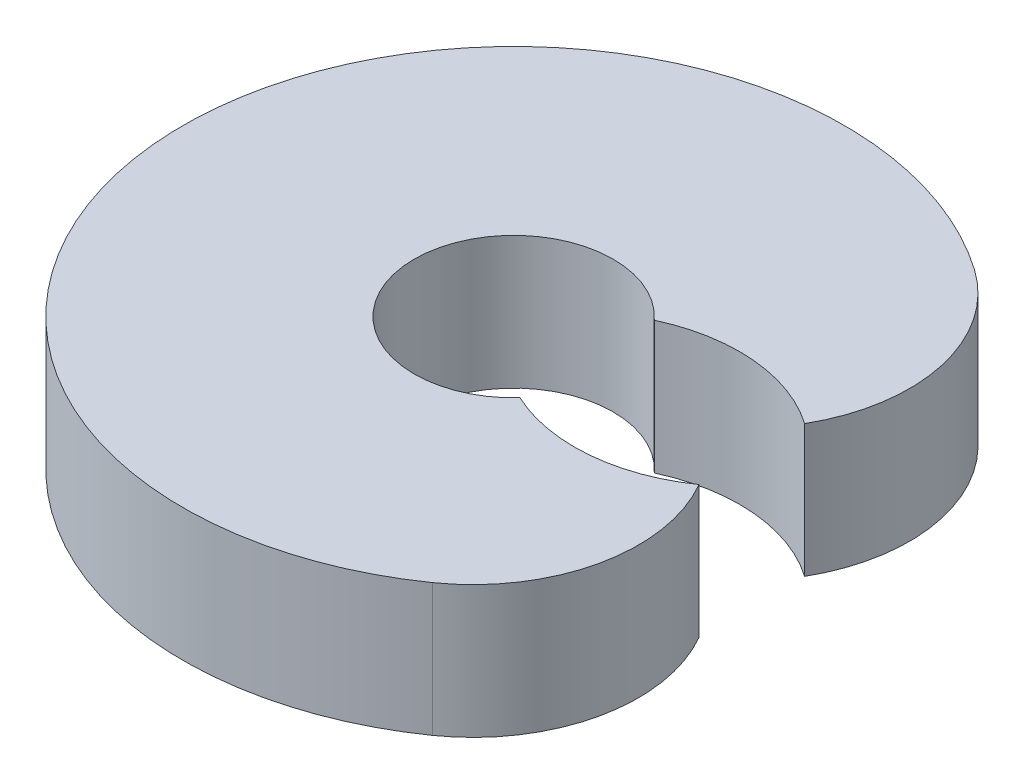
from build123d import *

# Parameters (mm, degrees)
BOSS_EXTRUDE1_START = 5
BOSS_EXTRUDE1_DEPTH = 200


with BuildPart() as part:
    # Sketch1 → Boss-Extrude1 (new body)
    with BuildSketch(Plane(origin=(0, 0, 0), x_dir=(1, 0, 0), z_dir=(0, 1, 0)).offset(BOSS_EXTRUDE1_START)):
        with BuildLine():
            ThreePointArc((286.788218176, 409.576022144), (-500, 0), (286.788218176, -409.576022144))
            ThreePointArc((286.788218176, -409.576022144), (387.468110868, -258.897914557), (359.900460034, -79.788011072))
            ThreePointArc((359.900460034, -79.788011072), (238.350624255, -123.969606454), (110.987220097, -101.498753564))
            ThreePointArc((110.987220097, -101.498753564), (-150.4, 0), (110.987220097, 101.498753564))
            ThreePointArc((110.987220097, 101.498753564), (238.350624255, 123.969606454), (359.900460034, 79.788011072))
            ThreePointArc((359.900460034, 79.788011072), (387.468110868, 258.897914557), (286.788218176, 409.576022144))
        make_face()
    extrude(amount=BOSS_EXTRUDE1_DEPTH)


solid = part.part
